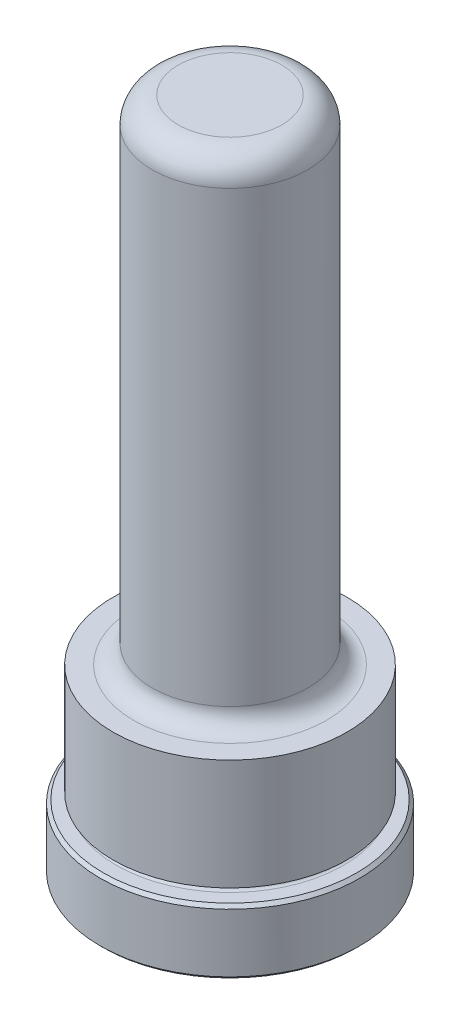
ISO-10303-21;
HEADER;
FILE_DESCRIPTION(('STEP AP214'),'2;1');
FILE_NAME('part.step','',(''),(''),'','','');
FILE_SCHEMA(('AUTOMOTIVE_DESIGN { 1 0 10303 214 1 1 1 1 }'));
ENDSEC;
DATA;
#1=APPLICATION_CONTEXT('core data for automotive mechanical design processes');
#2=APPLICATION_PROTOCOL_DEFINITION('international standard','automotive_design',2000,#1);
#3=PRODUCT_CONTEXT('',#1,'mechanical');
#4=PRODUCT('Part','Part','',(#3));
#5=PRODUCT_RELATED_PRODUCT_CATEGORY('part','',(#4));
#6=PRODUCT_DEFINITION_FORMATION('','',#4);
#7=PRODUCT_DEFINITION_CONTEXT('part definition',#1,'design');
#8=PRODUCT_DEFINITION('design','',#6,#7);
#9=PRODUCT_DEFINITION_SHAPE('','',#8);
#10=(LENGTH_UNIT() NAMED_UNIT(*) SI_UNIT(.MILLI.,.METRE.));
#11=(NAMED_UNIT(*) PLANE_ANGLE_UNIT() SI_UNIT($,.RADIAN.));
#12=(NAMED_UNIT(*) SI_UNIT($,.STERADIAN.) SOLID_ANGLE_UNIT());
#13=UNCERTAINTY_MEASURE_WITH_UNIT(LENGTH_MEASURE(1.E-05),#10,'distance_accuracy_value','');
#14=(GEOMETRIC_REPRESENTATION_CONTEXT(3) GLOBAL_UNCERTAINTY_ASSIGNED_CONTEXT((#13)) GLOBAL_UNIT_ASSIGNED_CONTEXT((#10,
#11,#12)) REPRESENTATION_CONTEXT('',''));
#15=CARTESIAN_POINT('',(0.,0.,0.));
#16=DIRECTION('',(0.,0.,1.));
#17=DIRECTION('',(1.,0.,0.));
#18=AXIS2_PLACEMENT_3D('',#15,#16,#17);
#19=CARTESIAN_POINT('',(0.,0.,0.));
#20=DIRECTION('',(0.,1.,0.));
#21=DIRECTION('',(0.,0.,1.));
#22=AXIS2_PLACEMENT_3D('',#19,#20,#21);
#23=PLANE('',#22);
#24=CARTESIAN_POINT('',(0.,0.,0.));
#25=DIRECTION('',(0.,1.,0.));
#26=DIRECTION('',(0.,0.,1.));
#27=AXIS2_PLACEMENT_3D('',#24,#25,#26);
#28=CIRCLE('',#27,15.494);
#29=CARTESIAN_POINT('',(0.,0.,15.494));
#30=VERTEX_POINT('',#29);
#31=EDGE_CURVE('E46',#30,#30,#28,.F.);
#32=ORIENTED_EDGE('',*,*,#31,.T.);
#33=EDGE_LOOP('',(#32));
#34=FACE_BOUND('',#33,.T.);
#35=ADVANCED_FACE('F31',(#34),#23,.F.);
#36=CARTESIAN_POINT('',(0.,0.,0.));
#37=DIRECTION('',(0.,1.,0.));
#38=DIRECTION('',(0.,0.,1.));
#39=AXIS2_PLACEMENT_3D('',#36,#37,#38);
#40=CYLINDRICAL_SURFACE('',#39,15.875);
#41=CARTESIAN_POINT('',(0.,0.380999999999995,0.));
#42=DIRECTION('',(0.,1.,0.));
#43=DIRECTION('',(0.,0.,1.));
#44=AXIS2_PLACEMENT_3D('',#41,#42,#43);
#45=CIRCLE('',#44,15.875);
#46=CARTESIAN_POINT('',(0.,0.380999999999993,15.875));
#47=VERTEX_POINT('',#46);
#48=EDGE_CURVE('E51',#47,#47,#45,.T.);
#49=ORIENTED_EDGE('',*,*,#48,.T.);
#50=EDGE_LOOP('',(#49));
#51=FACE_BOUND('',#50,.T.);
#52=CARTESIAN_POINT('',(0.,7.5438,0.));
#53=DIRECTION('',(0.,-1.,0.));
#54=DIRECTION('',(0.,0.,-1.));
#55=AXIS2_PLACEMENT_3D('',#52,#53,#54);
#56=CIRCLE('',#55,15.875);
#57=CARTESIAN_POINT('',(0.,7.5438,-15.875));
#58=VERTEX_POINT('',#57);
#59=EDGE_CURVE('E54',#58,#58,#56,.T.);
#60=ORIENTED_EDGE('',*,*,#59,.T.);
#61=EDGE_LOOP('',(#60));
#62=FACE_BOUND('',#61,.T.);
#63=ADVANCED_FACE('F110',(#51,#62),#40,.T.);
#64=CARTESIAN_POINT('',(0.,7.9248,-15.875));
#65=DIRECTION('',(0.,-1.,0.));
#66=DIRECTION('',(0.,0.,-1.));
#67=AXIS2_PLACEMENT_3D('',#64,#65,#66);
#68=PLANE('',#67);
#69=CARTESIAN_POINT('',(0.,7.9248,0.));
#70=DIRECTION('',(0.,-1.,0.));
#71=DIRECTION('',(0.,0.,-1.));
#72=AXIS2_PLACEMENT_3D('',#69,#70,#71);
#73=CIRCLE('',#72,15.494);
#74=CARTESIAN_POINT('',(0.,7.9248,-15.494));
#75=VERTEX_POINT('',#74);
#76=EDGE_CURVE('E42',#75,#75,#73,.F.);
#77=ORIENTED_EDGE('',*,*,#76,.T.);
#78=EDGE_LOOP('',(#77));
#79=FACE_BOUND('',#78,.T.);
#80=CARTESIAN_POINT('',(0.,7.9248,0.));
#81=DIRECTION('',(0.,1.,0.));
#82=DIRECTION('',(0.,0.,1.));
#83=AXIS2_PLACEMENT_3D('',#80,#81,#82);
#84=CIRCLE('',#83,13.8938);
#85=CARTESIAN_POINT('',(0.,7.9248,13.8938));
#86=VERTEX_POINT('',#85);
#87=EDGE_CURVE('E57',#86,#86,#84,.T.);
#88=ORIENTED_EDGE('',*,*,#87,.F.);
#89=EDGE_LOOP('',(#88));
#90=FACE_BOUND('',#89,.T.);
#91=ADVANCED_FACE('F105',(#79,#90),#68,.F.);
#92=CARTESIAN_POINT('',(0.,8.3058,0.));
#93=DIRECTION('',(0.,1.,0.));
#94=DIRECTION('',(0.,0.,1.));
#95=AXIS2_PLACEMENT_3D('',#92,#93,#94);
#96=TOROIDAL_SURFACE('',#95,13.8938,0.381000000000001);
#97=CARTESIAN_POINT('',(0.,8.68680000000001,0.));
#98=DIRECTION('',(0.,1.,0.));
#99=DIRECTION('',(0.,0.,1.));
#100=AXIS2_PLACEMENT_3D('',#97,#98,#99);
#101=CIRCLE('',#100,13.8938);
#102=CARTESIAN_POINT('',(0.,8.6868,13.8938));
#103=VERTEX_POINT('',#102);
#104=EDGE_CURVE('E60',#103,#103,#101,.T.);
#105=ORIENTED_EDGE('',*,*,#104,.F.);
#106=EDGE_LOOP('',(#105));
#107=FACE_BOUND('',#106,.T.);
#108=ORIENTED_EDGE('',*,*,#87,.T.);
#109=EDGE_LOOP('',(#108));
#110=FACE_BOUND('',#109,.T.);
#111=ADVANCED_FACE('F99',(#107,#110),#96,.F.);
#112=CARTESIAN_POINT('',(0.,8.68680000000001,-13.8938));
#113=DIRECTION('',(0.,1.,0.));
#114=DIRECTION('',(0.,0.,1.));
#115=AXIS2_PLACEMENT_3D('',#112,#113,#114);
#116=PLANE('',#115);
#117=CARTESIAN_POINT('',(0.,8.6868,0.));
#118=DIRECTION('',(0.,1.,0.));
#119=DIRECTION('',(0.,0.,1.));
#120=AXIS2_PLACEMENT_3D('',#117,#118,#119);
#121=CIRCLE('',#120,14.3002);
#122=CARTESIAN_POINT('',(0.,8.6868,14.3002));
#123=VERTEX_POINT('',#122);
#124=EDGE_CURVE('E63',#123,#123,#121,.T.);
#125=ORIENTED_EDGE('',*,*,#124,.F.);
#126=EDGE_LOOP('',(#125));
#127=FACE_BOUND('',#126,.T.);
#128=ORIENTED_EDGE('',*,*,#104,.T.);
#129=EDGE_LOOP('',(#128));
#130=FACE_BOUND('',#129,.T.);
#131=ADVANCED_FACE('F93',(#127,#130),#116,.F.);
#132=CARTESIAN_POINT('',(0.,0.,0.));
#133=DIRECTION('',(0.,1.,0.));
#134=DIRECTION('',(0.,0.,1.));
#135=AXIS2_PLACEMENT_3D('',#132,#133,#134);
#136=CYLINDRICAL_SURFACE('',#135,14.3002);
#137=CARTESIAN_POINT('',(0.,22.225,0.));
#138=DIRECTION('',(0.,1.,0.));
#139=DIRECTION('',(0.,0.,1.));
#140=AXIS2_PLACEMENT_3D('',#137,#138,#139);
#141=CIRCLE('',#140,14.3002);
#142=CARTESIAN_POINT('',(0.,22.225,14.3002));
#143=VERTEX_POINT('',#142);
#144=EDGE_CURVE('E66',#143,#143,#141,.T.);
#145=ORIENTED_EDGE('',*,*,#144,.F.);
#146=EDGE_LOOP('',(#145));
#147=FACE_BOUND('',#146,.T.);
#148=ORIENTED_EDGE('',*,*,#124,.T.);
#149=EDGE_LOOP('',(#148));
#150=FACE_BOUND('',#149,.T.);
#151=ADVANCED_FACE('F87',(#147,#150),#136,.T.);
#152=CARTESIAN_POINT('',(0.,22.225,-14.3002));
#153=DIRECTION('',(0.,-1.,0.));
#154=DIRECTION('',(0.,0.,-1.));
#155=AXIS2_PLACEMENT_3D('',#152,#153,#154);
#156=PLANE('',#155);
#157=CARTESIAN_POINT('',(0.,22.225,0.));
#158=DIRECTION('',(0.,1.,0.));
#159=DIRECTION('',(0.,0.,1.));
#160=AXIS2_PLACEMENT_3D('',#157,#158,#159);
#161=CIRCLE('',#160,11.7983);
#162=CARTESIAN_POINT('',(0.,22.225,11.7983));
#163=VERTEX_POINT('',#162);
#164=EDGE_CURVE('E69',#163,#163,#161,.T.);
#165=ORIENTED_EDGE('',*,*,#164,.F.);
#166=EDGE_LOOP('',(#165));
#167=FACE_BOUND('',#166,.T.);
#168=ORIENTED_EDGE('',*,*,#144,.T.);
#169=EDGE_LOOP('',(#168));
#170=FACE_BOUND('',#169,.T.);
#171=ADVANCED_FACE('F81',(#167,#170),#156,.F.);
#172=CARTESIAN_POINT('',(0.,24.511,0.));
#173=DIRECTION('',(0.,1.,0.));
#174=DIRECTION('',(0.,0.,1.));
#175=AXIS2_PLACEMENT_3D('',#172,#173,#174);
#176=TOROIDAL_SURFACE('',#175,11.7983,2.286);
#177=CARTESIAN_POINT('',(0.,24.511,0.));
#178=DIRECTION('',(0.,1.,0.));
#179=DIRECTION('',(0.,0.,1.));
#180=AXIS2_PLACEMENT_3D('',#177,#178,#179);
#181=CIRCLE('',#180,9.51229999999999);
#182=CARTESIAN_POINT('',(0.,24.511,9.5123));
#183=VERTEX_POINT('',#182);
#184=EDGE_CURVE('E72',#183,#183,#181,.T.);
#185=ORIENTED_EDGE('',*,*,#184,.F.);
#186=EDGE_LOOP('',(#185));
#187=FACE_BOUND('',#186,.T.);
#188=ORIENTED_EDGE('',*,*,#164,.T.);
#189=EDGE_LOOP('',(#188));
#190=FACE_BOUND('',#189,.T.);
#191=ADVANCED_FACE('F78',(#187,#190),#176,.F.);
#192=CARTESIAN_POINT('',(0.,0.,0.));
#193=DIRECTION('',(0.,1.,0.));
#194=DIRECTION('',(0.,0.,1.));
#195=AXIS2_PLACEMENT_3D('',#192,#193,#194);
#196=CYLINDRICAL_SURFACE('',#195,9.5123);
#197=CARTESIAN_POINT('',(0.,79.375,0.));
#198=DIRECTION('',(0.,-1.,0.));
#199=DIRECTION('',(0.,0.,-1.));
#200=AXIS2_PLACEMENT_3D('',#197,#198,#199);
#201=CIRCLE('',#200,9.5123);
#202=CARTESIAN_POINT('',(0.,79.375,-9.51229999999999));
#203=VERTEX_POINT('',#202);
#204=EDGE_CURVE('E10',#203,#203,#201,.T.);
#205=ORIENTED_EDGE('',*,*,#204,.T.);
#206=EDGE_LOOP('',(#205));
#207=FACE_BOUND('',#206,.T.);
#208=ORIENTED_EDGE('',*,*,#184,.T.);
#209=EDGE_LOOP('',(#208));
#210=FACE_BOUND('',#209,.T.);
#211=ADVANCED_FACE('F76',(#207,#210),#196,.T.);
#212=CARTESIAN_POINT('',(0.,82.55,-9.5123));
#213=DIRECTION('',(0.,-1.,0.));
#214=DIRECTION('',(0.,0.,-1.));
#215=AXIS2_PLACEMENT_3D('',#212,#213,#214);
#216=PLANE('',#215);
#217=CARTESIAN_POINT('',(0.,82.55,0.));
#218=DIRECTION('',(0.,-1.,0.));
#219=DIRECTION('',(0.,0.,-1.));
#220=AXIS2_PLACEMENT_3D('',#217,#218,#219);
#221=CIRCLE('',#220,6.3373);
#222=CARTESIAN_POINT('',(0.,82.55,-6.33729999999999));
#223=VERTEX_POINT('',#222);
#224=EDGE_CURVE('E38',#223,#223,#221,.F.);
#225=ORIENTED_EDGE('',*,*,#224,.T.);
#226=EDGE_LOOP('',(#225));
#227=FACE_BOUND('',#226,.T.);
#228=ADVANCED_FACE('F127',(#227),#216,.F.);
#229=CARTESIAN_POINT('',(0.,0.380999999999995,0.));
#230=DIRECTION('',(0.,1.,0.));
#231=DIRECTION('',(0.,0.,1.));
#232=AXIS2_PLACEMENT_3D('',#229,#230,#231);
#233=CONICAL_SURFACE('',#232,15.875,0.785398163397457);
#234=ORIENTED_EDGE('',*,*,#31,.F.);
#235=EDGE_LOOP('',(#234));
#236=FACE_BOUND('',#235,.T.);
#237=ORIENTED_EDGE('',*,*,#48,.F.);
#238=EDGE_LOOP('',(#237));
#239=FACE_BOUND('',#238,.T.);
#240=ADVANCED_FACE('F124',(#236,#239),#233,.T.);
#241=CARTESIAN_POINT('',(0.,7.9248,0.));
#242=DIRECTION('',(0.,-1.,0.));
#243=DIRECTION('',(0.,0.,-1.));
#244=AXIS2_PLACEMENT_3D('',#241,#242,#243);
#245=CONICAL_SURFACE('',#244,15.494,0.78539816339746);
#246=ORIENTED_EDGE('',*,*,#59,.F.);
#247=EDGE_LOOP('',(#246));
#248=FACE_BOUND('',#247,.T.);
#249=ORIENTED_EDGE('',*,*,#76,.F.);
#250=EDGE_LOOP('',(#249));
#251=FACE_BOUND('',#250,.T.);
#252=ADVANCED_FACE('F126',(#248,#251),#245,.T.);
#253=CARTESIAN_POINT('',(0.,79.375,0.));
#254=DIRECTION('',(0.,-1.,0.));
#255=DIRECTION('',(0.,0.,-1.));
#256=AXIS2_PLACEMENT_3D('',#253,#254,#255);
#257=TOROIDAL_SURFACE('',#256,6.3373,3.175);
#258=ORIENTED_EDGE('',*,*,#204,.F.);
#259=EDGE_LOOP('',(#258));
#260=FACE_BOUND('',#259,.T.);
#261=ORIENTED_EDGE('',*,*,#224,.F.);
#262=EDGE_LOOP('',(#261));
#263=FACE_BOUND('',#262,.T.);
#264=ADVANCED_FACE('F33',(#260,#263),#257,.T.);
#265=CLOSED_SHELL('',(#35,#63,#91,#111,#131,#151,#171,#191,#211,#228,#240,#252,#264));
#266=MANIFOLD_SOLID_BREP('B2',#265);
#267=ADVANCED_BREP_SHAPE_REPRESENTATION('',(#18,#266),#14);
#268=SHAPE_DEFINITION_REPRESENTATION(#9,#267);
ENDSEC;
END-ISO-10303-21;
